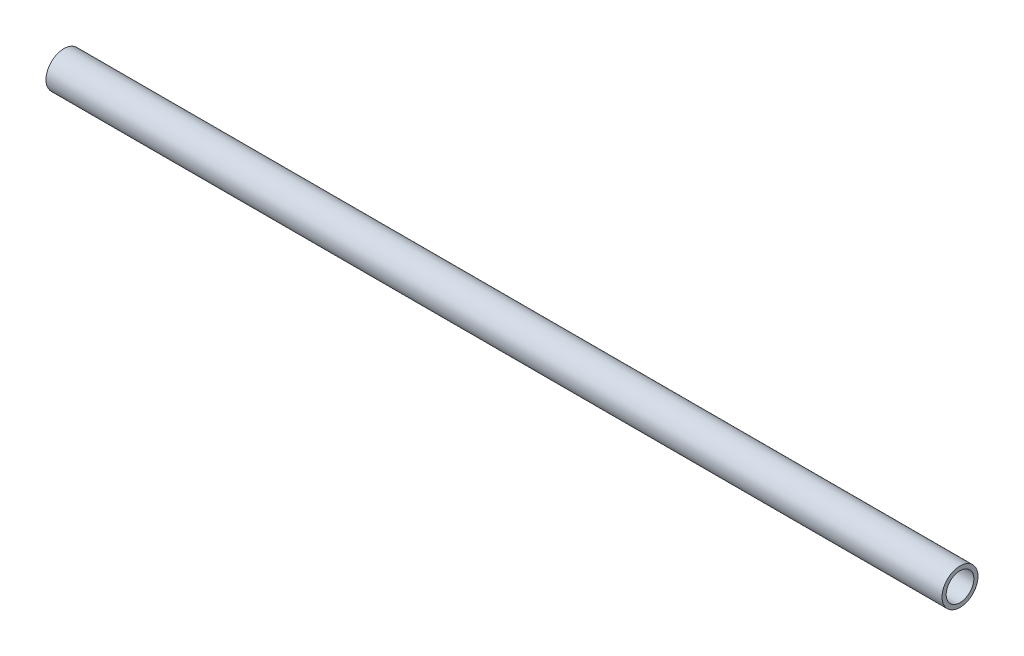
ISO-10303-21;
HEADER;
FILE_DESCRIPTION(('STEP AP214'),'2;1');
FILE_NAME('part.step','',(''),(''),'','','');
FILE_SCHEMA(('AUTOMOTIVE_DESIGN { 1 0 10303 214 1 1 1 1 }'));
ENDSEC;
DATA;
#1=APPLICATION_CONTEXT('core data for automotive mechanical design processes');
#2=APPLICATION_PROTOCOL_DEFINITION('international standard','automotive_design',2000,#1);
#3=PRODUCT_CONTEXT('',#1,'mechanical');
#4=PRODUCT('Part','Part','',(#3));
#5=PRODUCT_RELATED_PRODUCT_CATEGORY('part','',(#4));
#6=PRODUCT_DEFINITION_FORMATION('','',#4);
#7=PRODUCT_DEFINITION_CONTEXT('part definition',#1,'design');
#8=PRODUCT_DEFINITION('design','',#6,#7);
#9=PRODUCT_DEFINITION_SHAPE('','',#8);
#10=(LENGTH_UNIT() NAMED_UNIT(*) SI_UNIT(.MILLI.,.METRE.));
#11=(NAMED_UNIT(*) PLANE_ANGLE_UNIT() SI_UNIT($,.RADIAN.));
#12=(NAMED_UNIT(*) SI_UNIT($,.STERADIAN.) SOLID_ANGLE_UNIT());
#13=UNCERTAINTY_MEASURE_WITH_UNIT(LENGTH_MEASURE(1.E-05),#10,'distance_accuracy_value','');
#14=(GEOMETRIC_REPRESENTATION_CONTEXT(3) GLOBAL_UNCERTAINTY_ASSIGNED_CONTEXT((#13)) GLOBAL_UNIT_ASSIGNED_CONTEXT((#10,
#11,#12)) REPRESENTATION_CONTEXT('',''));
#15=CARTESIAN_POINT('',(0.,0.,0.));
#16=DIRECTION('',(0.,0.,1.));
#17=DIRECTION('',(1.,0.,0.));
#18=AXIS2_PLACEMENT_3D('',#15,#16,#17);
#19=CARTESIAN_POINT('',(822.325,2.22044604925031E-13,0.));
#20=DIRECTION('',(-1.,0.,0.));
#21=DIRECTION('',(0.,0.,1.));
#22=AXIS2_PLACEMENT_3D('',#19,#20,#21);
#23=CYLINDRICAL_SURFACE('',#22,12.7);
#24=CARTESIAN_POINT('',(822.325,2.22044604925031E-13,0.));
#25=DIRECTION('',(1.,0.,0.));
#26=DIRECTION('',(0.,0.,-1.));
#27=AXIS2_PLACEMENT_3D('',#24,#25,#26);
#28=CIRCLE('',#27,12.7);
#29=CARTESIAN_POINT('',(822.325,2.21339613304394E-13,-12.7));
#30=VERTEX_POINT('',#29);
#31=EDGE_CURVE('E40',#30,#30,#28,.T.);
#32=ORIENTED_EDGE('',*,*,#31,.T.);
#33=EDGE_LOOP('',(#32));
#34=FACE_BOUND('',#33,.T.);
#35=CARTESIAN_POINT('',(0.,0.,0.));
#36=DIRECTION('',(1.,0.,0.));
#37=DIRECTION('',(0.,0.,-1.));
#38=AXIS2_PLACEMENT_3D('',#35,#36,#37);
#39=CIRCLE('',#38,12.7);
#40=CARTESIAN_POINT('',(0.,0.,-12.7));
#41=VERTEX_POINT('',#40);
#42=EDGE_CURVE('E46',#41,#41,#39,.T.);
#43=ORIENTED_EDGE('',*,*,#42,.F.);
#44=EDGE_LOOP('',(#43));
#45=FACE_BOUND('',#44,.T.);
#46=ADVANCED_FACE('F33',(#34,#45),#23,.F.);
#47=CARTESIAN_POINT('',(822.325,2.22044604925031E-13,0.));
#48=DIRECTION('',(-1.,0.,0.));
#49=DIRECTION('',(0.,0.,1.));
#50=AXIS2_PLACEMENT_3D('',#47,#48,#49);
#51=CYLINDRICAL_SURFACE('',#50,16.51);
#52=CARTESIAN_POINT('',(822.325,2.22044604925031E-13,0.));
#53=DIRECTION('',(1.,0.,0.));
#54=DIRECTION('',(0.,0.,-1.));
#55=AXIS2_PLACEMENT_3D('',#52,#53,#54);
#56=CIRCLE('',#55,16.51);
#57=CARTESIAN_POINT('',(822.325,2.21128115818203E-13,-16.51));
#58=VERTEX_POINT('',#57);
#59=EDGE_CURVE('E10',#58,#58,#56,.T.);
#60=ORIENTED_EDGE('',*,*,#59,.F.);
#61=EDGE_LOOP('',(#60));
#62=FACE_BOUND('',#61,.T.);
#63=CARTESIAN_POINT('',(0.,0.,0.));
#64=DIRECTION('',(1.,0.,0.));
#65=DIRECTION('',(0.,0.,-1.));
#66=AXIS2_PLACEMENT_3D('',#63,#64,#65);
#67=CIRCLE('',#66,16.51);
#68=CARTESIAN_POINT('',(0.,0.,-16.51));
#69=VERTEX_POINT('',#68);
#70=EDGE_CURVE('E36',#69,#69,#67,.T.);
#71=ORIENTED_EDGE('',*,*,#70,.T.);
#72=EDGE_LOOP('',(#71));
#73=FACE_BOUND('',#72,.T.);
#74=ADVANCED_FACE('F53',(#62,#73),#51,.T.);
#75=CARTESIAN_POINT('',(822.325,2.22044604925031E-13,0.));
#76=DIRECTION('',(1.,0.,0.));
#77=DIRECTION('',(0.,0.,-1.));
#78=AXIS2_PLACEMENT_3D('',#75,#76,#77);
#79=PLANE('',#78);
#80=ORIENTED_EDGE('',*,*,#31,.F.);
#81=EDGE_LOOP('',(#80));
#82=FACE_BOUND('',#81,.T.);
#83=ORIENTED_EDGE('',*,*,#59,.T.);
#84=EDGE_LOOP('',(#83));
#85=FACE_BOUND('',#84,.T.);
#86=ADVANCED_FACE('F57',(#82,#85),#79,.T.);
#87=CARTESIAN_POINT('',(0.,0.,0.));
#88=DIRECTION('',(1.,0.,0.));
#89=DIRECTION('',(0.,0.,-1.));
#90=AXIS2_PLACEMENT_3D('',#87,#88,#89);
#91=PLANE('',#90);
#92=ORIENTED_EDGE('',*,*,#42,.T.);
#93=EDGE_LOOP('',(#92));
#94=FACE_BOUND('',#93,.T.);
#95=ORIENTED_EDGE('',*,*,#70,.F.);
#96=EDGE_LOOP('',(#95));
#97=FACE_BOUND('',#96,.T.);
#98=ADVANCED_FACE('F55',(#94,#97),#91,.F.);
#99=CLOSED_SHELL('',(#46,#74,#86,#98));
#100=MANIFOLD_SOLID_BREP('B2',#99);
#101=ADVANCED_BREP_SHAPE_REPRESENTATION('',(#18,#100),#14);
#102=SHAPE_DEFINITION_REPRESENTATION(#9,#101);
ENDSEC;
END-ISO-10303-21;
